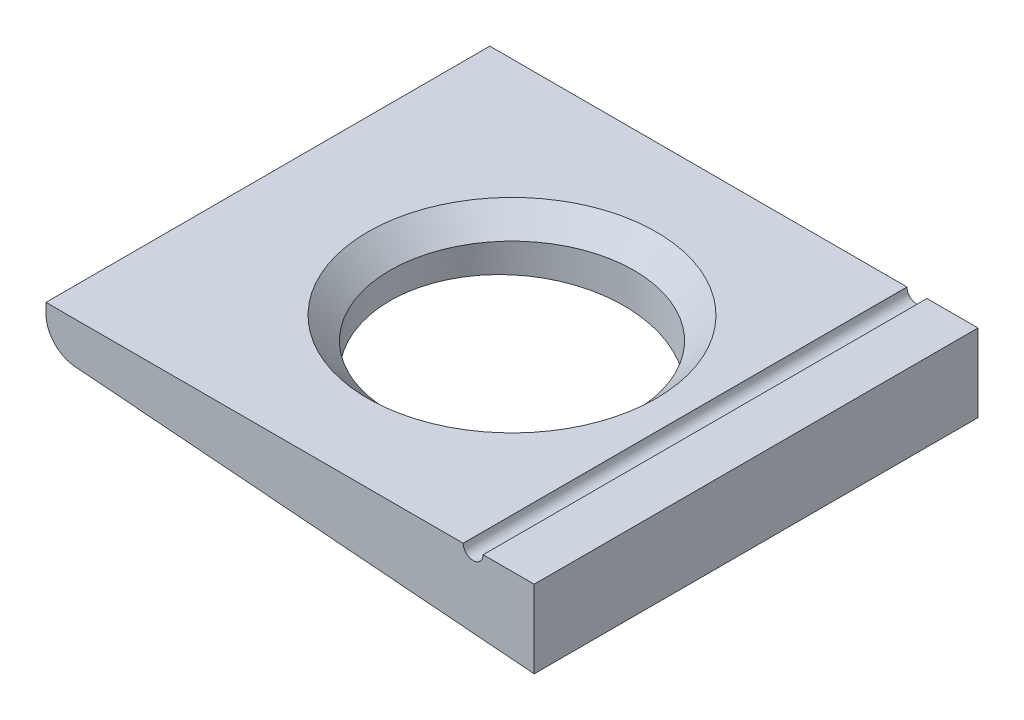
ISO-10303-21;
HEADER;
FILE_DESCRIPTION(('STEP AP214'),'2;1');
FILE_NAME('part.step','',(''),(''),'','','');
FILE_SCHEMA(('AUTOMOTIVE_DESIGN { 1 0 10303 214 1 1 1 1 }'));
ENDSEC;
DATA;
#1=APPLICATION_CONTEXT('core data for automotive mechanical design processes');
#2=APPLICATION_PROTOCOL_DEFINITION('international standard','automotive_design',2000,#1);
#3=PRODUCT_CONTEXT('',#1,'mechanical');
#4=PRODUCT('Part','Part','',(#3));
#5=PRODUCT_RELATED_PRODUCT_CATEGORY('part','',(#4));
#6=PRODUCT_DEFINITION_FORMATION('','',#4);
#7=PRODUCT_DEFINITION_CONTEXT('part definition',#1,'design');
#8=PRODUCT_DEFINITION('design','',#6,#7);
#9=PRODUCT_DEFINITION_SHAPE('','',#8);
#10=(LENGTH_UNIT() NAMED_UNIT(*) SI_UNIT(.MILLI.,.METRE.));
#11=(NAMED_UNIT(*) PLANE_ANGLE_UNIT() SI_UNIT($,.RADIAN.));
#12=(NAMED_UNIT(*) SI_UNIT($,.STERADIAN.) SOLID_ANGLE_UNIT());
#13=UNCERTAINTY_MEASURE_WITH_UNIT(LENGTH_MEASURE(1.E-05),#10,'distance_accuracy_value','');
#14=(GEOMETRIC_REPRESENTATION_CONTEXT(3) GLOBAL_UNCERTAINTY_ASSIGNED_CONTEXT((#13)) GLOBAL_UNIT_ASSIGNED_CONTEXT((#10,
#11,#12)) REPRESENTATION_CONTEXT('',''));
#15=CARTESIAN_POINT('',(0.,0.,0.));
#16=DIRECTION('',(0.,0.,1.));
#17=DIRECTION('',(1.,0.,0.));
#18=AXIS2_PLACEMENT_3D('',#15,#16,#17);
#19=CARTESIAN_POINT('',(22.,0.,20.));
#20=DIRECTION('',(0.,-1.,0.));
#21=DIRECTION('',(1.,0.,0.));
#22=AXIS2_PLACEMENT_3D('',#19,#20,#21);
#23=PLANE('',#22);
#24=DIRECTION('',(-1.,0.,0.));
#25=VECTOR('',#24,1.);
#26=CARTESIAN_POINT('',(22.,0.,-20.));
#27=LINE('',#26,#25);
#28=CARTESIAN_POINT('',(22.,0.,-20.));
#29=VERTEX_POINT('',#28);
#30=CARTESIAN_POINT('',(17.4,0.,-20.));
#31=VERTEX_POINT('',#30);
#32=EDGE_CURVE('E136',#29,#31,#27,.T.);
#33=ORIENTED_EDGE('',*,*,#32,.T.);
#34=DIRECTION('',(0.,0.,1.));
#35=VECTOR('',#34,1.);
#36=CARTESIAN_POINT('',(17.4,0.,-20.));
#37=LINE('',#36,#35);
#38=CARTESIAN_POINT('',(17.4,0.,20.));
#39=VERTEX_POINT('',#38);
#40=EDGE_CURVE('E54',#31,#39,#37,.T.);
#41=ORIENTED_EDGE('',*,*,#40,.T.);
#42=DIRECTION('',(-1.,0.,0.));
#43=VECTOR('',#42,1.);
#44=CARTESIAN_POINT('',(22.,0.,20.));
#45=LINE('',#44,#43);
#46=CARTESIAN_POINT('',(22.,0.,20.));
#47=VERTEX_POINT('',#46);
#48=EDGE_CURVE('E95',#47,#39,#45,.T.);
#49=ORIENTED_EDGE('',*,*,#48,.F.);
#50=DIRECTION('',(0.,0.,-1.));
#51=VECTOR('',#50,1.);
#52=CARTESIAN_POINT('',(22.,0.,20.));
#53=LINE('',#52,#51);
#54=EDGE_CURVE('E147',#47,#29,#53,.T.);
#55=ORIENTED_EDGE('',*,*,#54,.T.);
#56=EDGE_LOOP('',(#33,#41,#49,#55));
#57=FACE_BOUND('',#56,.T.);
#58=ADVANCED_FACE('F39',(#57),#23,.F.);
#59=CARTESIAN_POINT('',(22.,0.,20.));
#60=DIRECTION('',(-1.,0.,0.));
#61=DIRECTION('',(0.,0.,1.));
#62=AXIS2_PLACEMENT_3D('',#59,#60,#61);
#63=PLANE('',#62);
#64=DIRECTION('',(0.,1.,0.));
#65=VECTOR('',#64,1.);
#66=CARTESIAN_POINT('',(22.,0.,-20.));
#67=LINE('',#66,#65);
#68=CARTESIAN_POINT('',(22.,-7.,-20.));
#69=VERTEX_POINT('',#68);
#70=EDGE_CURVE('E131',#69,#29,#67,.T.);
#71=ORIENTED_EDGE('',*,*,#70,.T.);
#72=ORIENTED_EDGE('',*,*,#54,.F.);
#73=DIRECTION('',(0.,1.,0.));
#74=VECTOR('',#73,1.);
#75=CARTESIAN_POINT('',(22.,0.,20.));
#76=LINE('',#75,#74);
#77=CARTESIAN_POINT('',(22.,-7.,20.));
#78=VERTEX_POINT('',#77);
#79=EDGE_CURVE('E143',#78,#47,#76,.T.);
#80=ORIENTED_EDGE('',*,*,#79,.F.);
#81=DIRECTION('',(0.,0.,-1.));
#82=VECTOR('',#81,1.);
#83=CARTESIAN_POINT('',(22.,-7.,20.));
#84=LINE('',#83,#82);
#85=EDGE_CURVE('E127',#78,#69,#84,.T.);
#86=ORIENTED_EDGE('',*,*,#85,.T.);
#87=EDGE_LOOP('',(#71,#72,#80,#86));
#88=FACE_BOUND('',#87,.T.);
#89=ADVANCED_FACE('F168',(#88),#63,.F.);
#90=CARTESIAN_POINT('',(0.,0.,0.));
#91=DIRECTION('',(0.,-1.,0.));
#92=DIRECTION('',(1.,0.,0.));
#93=AXIS2_PLACEMENT_3D('',#90,#91,#92);
#94=CIRCLE('',#93,13.);
#95=CARTESIAN_POINT('',(13.,0.,0.));
#96=VERTEX_POINT('',#95);
#97=EDGE_CURVE('E11',#96,#96,#94,.T.);
#98=ORIENTED_EDGE('',*,*,#97,.T.);
#99=EDGE_LOOP('',(#98));
#100=FACE_BOUND('',#99,.T.);
#101=CARTESIAN_POINT('',(15.6,0.,20.));
#102=VERTEX_POINT('',#101);
#103=CARTESIAN_POINT('',(-22.,0.,20.));
#104=VERTEX_POINT('',#103);
#105=EDGE_CURVE('E110',#102,#104,#45,.T.);
#106=ORIENTED_EDGE('',*,*,#105,.F.);
#107=DIRECTION('',(0.,0.,1.));
#108=VECTOR('',#107,1.);
#109=CARTESIAN_POINT('',(15.6,0.,-20.));
#110=LINE('',#109,#108);
#111=CARTESIAN_POINT('',(15.6,0.,-20.));
#112=VERTEX_POINT('',#111);
#113=EDGE_CURVE('E187',#102,#112,#110,.F.);
#114=ORIENTED_EDGE('',*,*,#113,.T.);
#115=CARTESIAN_POINT('',(-22.,0.,-20.));
#116=VERTEX_POINT('',#115);
#117=EDGE_CURVE('E134',#112,#116,#27,.T.);
#118=ORIENTED_EDGE('',*,*,#117,.T.);
#119=DIRECTION('',(0.,0.,-1.));
#120=VECTOR('',#119,1.);
#121=CARTESIAN_POINT('',(-22.,0.,20.));
#122=LINE('',#121,#120);
#123=EDGE_CURVE('E122',#104,#116,#122,.T.);
#124=ORIENTED_EDGE('',*,*,#123,.F.);
#125=EDGE_LOOP('',(#106,#114,#118,#124));
#126=FACE_BOUND('',#125,.T.);
#127=ADVANCED_FACE('F170',(#100,#126),#23,.F.);
#128=CARTESIAN_POINT('',(-22.,0.,20.));
#129=DIRECTION('',(1.,0.,0.));
#130=DIRECTION('',(0.,1.,0.));
#131=AXIS2_PLACEMENT_3D('',#128,#129,#130);
#132=PLANE('',#131);
#133=DIRECTION('',(0.,-1.,0.));
#134=VECTOR('',#133,1.);
#135=CARTESIAN_POINT('',(-22.,0.,-20.));
#136=LINE('',#135,#134);
#137=CARTESIAN_POINT('',(-22.,-0.913882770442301,-20.));
#138=VERTEX_POINT('',#137);
#139=EDGE_CURVE('E119',#116,#138,#136,.T.);
#140=ORIENTED_EDGE('',*,*,#139,.T.);
#141=DIRECTION('',(0.,0.,-1.));
#142=VECTOR('',#141,1.);
#143=CARTESIAN_POINT('',(-22.,-0.913882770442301,20.));
#144=LINE('',#143,#142);
#145=CARTESIAN_POINT('',(-22.,-0.913882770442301,20.));
#146=VERTEX_POINT('',#145);
#147=EDGE_CURVE('E116',#146,#138,#144,.T.);
#148=ORIENTED_EDGE('',*,*,#147,.F.);
#149=DIRECTION('',(0.,-1.,0.));
#150=VECTOR('',#149,1.);
#151=CARTESIAN_POINT('',(-22.,0.,20.));
#152=LINE('',#151,#150);
#153=EDGE_CURVE('E102',#104,#146,#152,.T.);
#154=ORIENTED_EDGE('',*,*,#153,.F.);
#155=ORIENTED_EDGE('',*,*,#123,.T.);
#156=EDGE_LOOP('',(#140,#148,#154,#155));
#157=FACE_BOUND('',#156,.T.);
#158=ADVANCED_FACE('F117',(#157),#132,.F.);
#159=CARTESIAN_POINT('',(-19.2,-0.9138827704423,20.));
#160=DIRECTION('',(0.,0.,-1.));
#161=DIRECTION('',(-1.,0.,0.));
#162=AXIS2_PLACEMENT_3D('',#159,#160,#161);
#163=CYLINDRICAL_SURFACE('',#162,2.8);
#164=CARTESIAN_POINT('',(-19.2,-0.9138827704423,-20.));
#165=DIRECTION('',(0.,0.,1.));
#166=DIRECTION('',(-1.,0.,0.));
#167=AXIS2_PLACEMENT_3D('',#164,#165,#166);
#168=CIRCLE('',#167,2.8);
#169=CARTESIAN_POINT('',(-19.4220259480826,-3.70506611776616,-20.));
#170=VERTEX_POINT('',#169);
#171=EDGE_CURVE('E140',#138,#170,#168,.T.);
#172=ORIENTED_EDGE('',*,*,#171,.T.);
#173=DIRECTION('',(0.,0.,-1.));
#174=VECTOR('',#173,1.);
#175=CARTESIAN_POINT('',(-19.4220259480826,-3.70506611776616,20.));
#176=LINE('',#175,#174);
#177=CARTESIAN_POINT('',(-19.4220259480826,-3.70506611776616,20.));
#178=VERTEX_POINT('',#177);
#179=EDGE_CURVE('E123',#178,#170,#176,.T.);
#180=ORIENTED_EDGE('',*,*,#179,.F.);
#181=CARTESIAN_POINT('',(-19.2,-0.9138827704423,20.));
#182=DIRECTION('',(0.,0.,1.));
#183=DIRECTION('',(-1.,0.,0.));
#184=AXIS2_PLACEMENT_3D('',#181,#182,#183);
#185=CIRCLE('',#184,2.8);
#186=EDGE_CURVE('E106',#146,#178,#185,.T.);
#187=ORIENTED_EDGE('',*,*,#186,.F.);
#188=ORIENTED_EDGE('',*,*,#147,.T.);
#189=EDGE_LOOP('',(#172,#180,#187,#188));
#190=FACE_BOUND('',#189,.T.);
#191=ADVANCED_FACE('F125',(#190),#163,.T.);
#192=CARTESIAN_POINT('',(22.,-7.,20.));
#193=DIRECTION('',(0.0792949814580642,0.996851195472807,0.));
#194=DIRECTION('',(-0.996851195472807,0.0792949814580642,0.));
#195=AXIS2_PLACEMENT_3D('',#192,#193,#194);
#196=PLANE('',#195);
#197=CARTESIAN_POINT('',(0.,-5.25,0.));
#198=DIRECTION('',(0.0792949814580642,0.996851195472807,0.));
#199=DIRECTION('',(-0.996851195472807,0.0792949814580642,0.));
#200=AXIS2_PLACEMENT_3D('',#197,#198,#199);
#201=ELLIPSE('',#200,11.0347462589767,11.);
#202=CARTESIAN_POINT('',(-11.,-4.375,0.));
#203=VERTEX_POINT('',#202);
#204=EDGE_CURVE('E135',#203,#203,#201,.T.);
#205=ORIENTED_EDGE('',*,*,#204,.T.);
#206=EDGE_LOOP('',(#205));
#207=FACE_BOUND('',#206,.T.);
#208=DIRECTION('',(0.996851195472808,-0.0792949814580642,0.));
#209=VECTOR('',#208,1.);
#210=CARTESIAN_POINT('',(22.,-7.,-20.));
#211=LINE('',#210,#209);
#212=EDGE_CURVE('E87',#170,#69,#211,.T.);
#213=ORIENTED_EDGE('',*,*,#212,.T.);
#214=ORIENTED_EDGE('',*,*,#85,.F.);
#215=DIRECTION('',(0.996851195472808,-0.0792949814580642,0.));
#216=VECTOR('',#215,1.);
#217=CARTESIAN_POINT('',(22.,-7.,20.));
#218=LINE('',#217,#216);
#219=EDGE_CURVE('E63',#178,#78,#218,.T.);
#220=ORIENTED_EDGE('',*,*,#219,.F.);
#221=ORIENTED_EDGE('',*,*,#179,.T.);
#222=EDGE_LOOP('',(#213,#214,#220,#221));
#223=FACE_BOUND('',#222,.T.);
#224=ADVANCED_FACE('F201',(#207,#223),#196,.F.);
#225=CARTESIAN_POINT('',(-19.2,-0.9138827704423,20.));
#226=DIRECTION('',(0.,0.,-1.));
#227=DIRECTION('',(-1.,0.,0.));
#228=AXIS2_PLACEMENT_3D('',#225,#226,#227);
#229=PLANE('',#228);
#230=ORIENTED_EDGE('',*,*,#48,.T.);
#231=CARTESIAN_POINT('',(16.5,0.,20.));
#232=DIRECTION('',(0.,0.,1.));
#233=DIRECTION('',(1.,0.,0.));
#234=AXIS2_PLACEMENT_3D('',#231,#232,#233);
#235=CIRCLE('',#234,0.9);
#236=EDGE_CURVE('E194',#102,#39,#235,.T.);
#237=ORIENTED_EDGE('',*,*,#236,.F.);
#238=ORIENTED_EDGE('',*,*,#105,.T.);
#239=ORIENTED_EDGE('',*,*,#153,.T.);
#240=ORIENTED_EDGE('',*,*,#186,.T.);
#241=ORIENTED_EDGE('',*,*,#219,.T.);
#242=ORIENTED_EDGE('',*,*,#79,.T.);
#243=EDGE_LOOP('',(#230,#237,#238,#239,#240,#241,#242));
#244=FACE_BOUND('',#243,.T.);
#245=ADVANCED_FACE('F104',(#244),#229,.F.);
#246=CARTESIAN_POINT('',(-19.2,-0.9138827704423,-20.));
#247=DIRECTION('',(0.,0.,-1.));
#248=DIRECTION('',(-1.,0.,0.));
#249=AXIS2_PLACEMENT_3D('',#246,#247,#248);
#250=PLANE('',#249);
#251=CARTESIAN_POINT('',(16.5,0.,-20.));
#252=DIRECTION('',(0.,0.,-1.));
#253=DIRECTION('',(-1.,0.,0.));
#254=AXIS2_PLACEMENT_3D('',#251,#252,#253);
#255=CIRCLE('',#254,0.9);
#256=EDGE_CURVE('E149',#31,#112,#255,.T.);
#257=ORIENTED_EDGE('',*,*,#256,.F.);
#258=ORIENTED_EDGE('',*,*,#32,.F.);
#259=ORIENTED_EDGE('',*,*,#70,.F.);
#260=ORIENTED_EDGE('',*,*,#212,.F.);
#261=ORIENTED_EDGE('',*,*,#171,.F.);
#262=ORIENTED_EDGE('',*,*,#139,.F.);
#263=ORIENTED_EDGE('',*,*,#117,.F.);
#264=EDGE_LOOP('',(#257,#258,#259,#260,#261,#262,#263));
#265=FACE_BOUND('',#264,.T.);
#266=ADVANCED_FACE('F199',(#265),#250,.T.);
#267=CARTESIAN_POINT('',(0.,-7.,0.));
#268=DIRECTION('',(0.,1.,0.));
#269=DIRECTION('',(-1.,0.,0.));
#270=AXIS2_PLACEMENT_3D('',#267,#268,#269);
#271=CYLINDRICAL_SURFACE('',#270,11.);
#272=CARTESIAN_POINT('',(0.,-2.,0.));
#273=DIRECTION('',(0.,-1.,0.));
#274=DIRECTION('',(1.,0.,0.));
#275=AXIS2_PLACEMENT_3D('',#272,#273,#274);
#276=CIRCLE('',#275,11.);
#277=CARTESIAN_POINT('',(11.,-2.,0.));
#278=VERTEX_POINT('',#277);
#279=EDGE_CURVE('E47',#278,#278,#276,.F.);
#280=ORIENTED_EDGE('',*,*,#279,.T.);
#281=EDGE_LOOP('',(#280));
#282=FACE_BOUND('',#281,.T.);
#283=ORIENTED_EDGE('',*,*,#204,.F.);
#284=EDGE_LOOP('',(#283));
#285=FACE_BOUND('',#284,.T.);
#286=ADVANCED_FACE('F155',(#282,#285),#271,.F.);
#287=CARTESIAN_POINT('',(16.5,0.,-20.));
#288=DIRECTION('',(0.,0.,1.));
#289=DIRECTION('',(1.,0.,0.));
#290=AXIS2_PLACEMENT_3D('',#287,#288,#289);
#291=CYLINDRICAL_SURFACE('',#290,0.9);
#292=ORIENTED_EDGE('',*,*,#256,.T.);
#293=ORIENTED_EDGE('',*,*,#113,.F.);
#294=ORIENTED_EDGE('',*,*,#236,.T.);
#295=ORIENTED_EDGE('',*,*,#40,.F.);
#296=EDGE_LOOP('',(#292,#293,#294,#295));
#297=FACE_BOUND('',#296,.T.);
#298=ADVANCED_FACE('F159',(#297),#291,.F.);
#299=CARTESIAN_POINT('',(0.,-2.,0.));
#300=DIRECTION('',(0.,1.,0.));
#301=DIRECTION('',(-1.,0.,0.));
#302=AXIS2_PLACEMENT_3D('',#299,#300,#301);
#303=CONICAL_SURFACE('',#302,11.,0.78539816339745);
#304=ORIENTED_EDGE('',*,*,#97,.F.);
#305=EDGE_LOOP('',(#304));
#306=FACE_BOUND('',#305,.T.);
#307=ORIENTED_EDGE('',*,*,#279,.F.);
#308=EDGE_LOOP('',(#307));
#309=FACE_BOUND('',#308,.T.);
#310=ADVANCED_FACE('F41',(#306,#309),#303,.F.);
#311=CLOSED_SHELL('',(#58,#89,#127,#158,#191,#224,#245,#266,#286,#298,#310));
#312=MANIFOLD_SOLID_BREP('B2',#311);
#313=ADVANCED_BREP_SHAPE_REPRESENTATION('',(#18,#312),#14);
#314=SHAPE_DEFINITION_REPRESENTATION(#9,#313);
ENDSEC;
END-ISO-10303-21;
